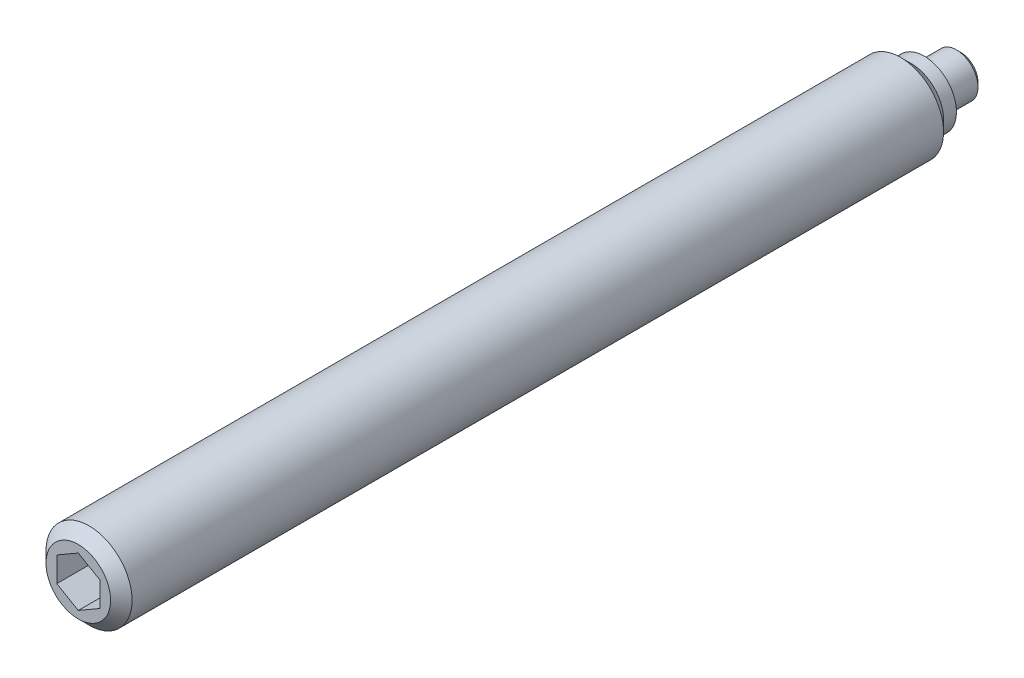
ISO-10303-21;
HEADER;
FILE_DESCRIPTION(('STEP AP214'),'2;1');
FILE_NAME('part.step','',(''),(''),'','','');
FILE_SCHEMA(('AUTOMOTIVE_DESIGN { 1 0 10303 214 1 1 1 1 }'));
ENDSEC;
DATA;
#1=APPLICATION_CONTEXT('core data for automotive mechanical design processes');
#2=APPLICATION_PROTOCOL_DEFINITION('international standard','automotive_design',2000,#1);
#3=PRODUCT_CONTEXT('',#1,'mechanical');
#4=PRODUCT('Part','Part','',(#3));
#5=PRODUCT_RELATED_PRODUCT_CATEGORY('part','',(#4));
#6=PRODUCT_DEFINITION_FORMATION('','',#4);
#7=PRODUCT_DEFINITION_CONTEXT('part definition',#1,'design');
#8=PRODUCT_DEFINITION('design','',#6,#7);
#9=PRODUCT_DEFINITION_SHAPE('','',#8);
#10=(LENGTH_UNIT() NAMED_UNIT(*) SI_UNIT(.MILLI.,.METRE.));
#11=(NAMED_UNIT(*) PLANE_ANGLE_UNIT() SI_UNIT($,.RADIAN.));
#12=(NAMED_UNIT(*) SI_UNIT($,.STERADIAN.) SOLID_ANGLE_UNIT());
#13=UNCERTAINTY_MEASURE_WITH_UNIT(LENGTH_MEASURE(1.E-05),#10,'distance_accuracy_value','');
#14=(GEOMETRIC_REPRESENTATION_CONTEXT(3) GLOBAL_UNCERTAINTY_ASSIGNED_CONTEXT((#13)) GLOBAL_UNIT_ASSIGNED_CONTEXT((#10,
#11,#12)) REPRESENTATION_CONTEXT('',''));
#15=CARTESIAN_POINT('',(0.,0.,0.));
#16=DIRECTION('',(0.,0.,1.));
#17=DIRECTION('',(1.,0.,0.));
#18=AXIS2_PLACEMENT_3D('',#15,#16,#17);
#19=CARTESIAN_POINT('',(0.,0.,0.));
#20=DIRECTION('',(0.,0.,-1.));
#21=DIRECTION('',(-1.,0.,0.));
#22=AXIS2_PLACEMENT_3D('',#19,#20,#21);
#23=CYLINDRICAL_SURFACE('',#22,1.);
#24=CARTESIAN_POINT('',(0.,0.,0.2));
#25=DIRECTION('',(0.,0.,-1.));
#26=DIRECTION('',(-1.,0.,0.));
#27=AXIS2_PLACEMENT_3D('',#24,#25,#26);
#28=CIRCLE('',#27,1.);
#29=CARTESIAN_POINT('',(-1.,0.,0.2));
#30=VERTEX_POINT('',#29);
#31=EDGE_CURVE('E133',#30,#30,#28,.T.);
#32=ORIENTED_EDGE('',*,*,#31,.F.);
#33=EDGE_LOOP('',(#32));
#34=FACE_BOUND('',#33,.T.);
#35=CARTESIAN_POINT('',(0.,0.,1.7));
#36=DIRECTION('',(0.,0.,-1.));
#37=DIRECTION('',(-1.,0.,0.));
#38=AXIS2_PLACEMENT_3D('',#35,#36,#37);
#39=CIRCLE('',#38,1.);
#40=CARTESIAN_POINT('',(-1.,0.,1.7));
#41=VERTEX_POINT('',#40);
#42=EDGE_CURVE('E127',#41,#41,#39,.T.);
#43=ORIENTED_EDGE('',*,*,#42,.T.);
#44=EDGE_LOOP('',(#43));
#45=FACE_BOUND('',#44,.T.);
#46=ADVANCED_FACE('F14',(#34,#45),#23,.T.);
#47=CARTESIAN_POINT('',(0.,0.,0.2));
#48=DIRECTION('',(0.,0.,1.));
#49=DIRECTION('',(1.,0.,0.));
#50=AXIS2_PLACEMENT_3D('',#47,#48,#49);
#51=CONICAL_SURFACE('',#50,1.,0.785398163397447);
#52=CARTESIAN_POINT('',(0.,0.,0.));
#53=DIRECTION('',(0.,0.,-1.));
#54=DIRECTION('',(-1.,0.,0.));
#55=AXIS2_PLACEMENT_3D('',#52,#53,#54);
#56=CIRCLE('',#55,0.8);
#57=CARTESIAN_POINT('',(-0.8,0.,0.));
#58=VERTEX_POINT('',#57);
#59=EDGE_CURVE('E130',#58,#58,#56,.T.);
#60=ORIENTED_EDGE('',*,*,#59,.F.);
#61=EDGE_LOOP('',(#60));
#62=FACE_BOUND('',#61,.T.);
#63=ORIENTED_EDGE('',*,*,#31,.T.);
#64=EDGE_LOOP('',(#63));
#65=FACE_BOUND('',#64,.T.);
#66=ADVANCED_FACE('F157',(#62,#65),#51,.T.);
#67=CARTESIAN_POINT('',(0.,0.8,0.));
#68=DIRECTION('',(0.,0.,1.));
#69=DIRECTION('',(1.,0.,0.));
#70=AXIS2_PLACEMENT_3D('',#67,#68,#69);
#71=PLANE('',#70);
#72=ORIENTED_EDGE('',*,*,#59,.T.);
#73=EDGE_LOOP('',(#72));
#74=FACE_BOUND('',#73,.T.);
#75=ADVANCED_FACE('F154',(#74),#71,.F.);
#76=CARTESIAN_POINT('',(0.,0.,1.7));
#77=DIRECTION('',(0.,0.,-1.));
#78=DIRECTION('',(-1.,0.,0.));
#79=AXIS2_PLACEMENT_3D('',#76,#77,#78);
#80=CYLINDRICAL_SURFACE('',#79,2.);
#81=CARTESIAN_POINT('',(0.,0.,2.8));
#82=DIRECTION('',(0.,0.,-1.));
#83=DIRECTION('',(-1.,0.,0.));
#84=AXIS2_PLACEMENT_3D('',#81,#82,#83);
#85=CIRCLE('',#84,2.);
#86=CARTESIAN_POINT('',(-2.,0.,2.8));
#87=VERTEX_POINT('',#86);
#88=EDGE_CURVE('E9',#87,#87,#85,.T.);
#89=ORIENTED_EDGE('',*,*,#88,.F.);
#90=EDGE_LOOP('',(#89));
#91=FACE_BOUND('',#90,.T.);
#92=CARTESIAN_POINT('',(0.,0.,40.5));
#93=DIRECTION('',(0.,0.,1.));
#94=DIRECTION('',(1.,0.,0.));
#95=AXIS2_PLACEMENT_3D('',#92,#93,#94);
#96=CIRCLE('',#95,2.);
#97=CARTESIAN_POINT('',(2.,0.,40.5));
#98=VERTEX_POINT('',#97);
#99=EDGE_CURVE('E124',#98,#98,#96,.T.);
#100=ORIENTED_EDGE('',*,*,#99,.F.);
#101=EDGE_LOOP('',(#100));
#102=FACE_BOUND('',#101,.T.);
#103=ADVANCED_FACE('F16',(#91,#102),#80,.T.);
#104=CARTESIAN_POINT('',(0.,0.,2.8));
#105=DIRECTION('',(0.,0.,1.));
#106=DIRECTION('',(1.,0.,0.));
#107=AXIS2_PLACEMENT_3D('',#104,#105,#106);
#108=CONICAL_SURFACE('',#107,2.,0.785398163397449);
#109=ORIENTED_EDGE('',*,*,#88,.T.);
#110=EDGE_LOOP('',(#109));
#111=FACE_BOUND('',#110,.T.);
#112=CARTESIAN_POINT('',(0.,0.,2.3));
#113=DIRECTION('',(0.,0.,-1.));
#114=DIRECTION('',(-1.,0.,0.));
#115=AXIS2_PLACEMENT_3D('',#112,#113,#114);
#116=CIRCLE('',#115,1.5);
#117=CARTESIAN_POINT('',(-1.5,0.,2.3));
#118=VERTEX_POINT('',#117);
#119=EDGE_CURVE('E22',#118,#118,#116,.T.);
#120=ORIENTED_EDGE('',*,*,#119,.F.);
#121=EDGE_LOOP('',(#120));
#122=FACE_BOUND('',#121,.T.);
#123=ADVANCED_FACE('F143',(#111,#122),#108,.T.);
#124=CARTESIAN_POINT('',(0.,0.,1.7));
#125=DIRECTION('',(0.,0.,-1.));
#126=DIRECTION('',(-1.,0.,0.));
#127=AXIS2_PLACEMENT_3D('',#124,#125,#126);
#128=CYLINDRICAL_SURFACE('',#127,1.5);
#129=CARTESIAN_POINT('',(0.,0.,1.7));
#130=DIRECTION('',(0.,0.,-1.));
#131=DIRECTION('',(-1.,0.,0.));
#132=AXIS2_PLACEMENT_3D('',#129,#130,#131);
#133=CIRCLE('',#132,1.5);
#134=CARTESIAN_POINT('',(-1.5,0.,1.7));
#135=VERTEX_POINT('',#134);
#136=EDGE_CURVE('E136',#135,#135,#133,.T.);
#137=ORIENTED_EDGE('',*,*,#136,.F.);
#138=EDGE_LOOP('',(#137));
#139=FACE_BOUND('',#138,.T.);
#140=ORIENTED_EDGE('',*,*,#119,.T.);
#141=EDGE_LOOP('',(#140));
#142=FACE_BOUND('',#141,.T.);
#143=ADVANCED_FACE('F141',(#139,#142),#128,.T.);
#144=CARTESIAN_POINT('',(0.,1.5,1.7));
#145=DIRECTION('',(0.,0.,1.));
#146=DIRECTION('',(1.,0.,0.));
#147=AXIS2_PLACEMENT_3D('',#144,#145,#146);
#148=PLANE('',#147);
#149=ORIENTED_EDGE('',*,*,#136,.T.);
#150=EDGE_LOOP('',(#149));
#151=FACE_BOUND('',#150,.T.);
#152=ORIENTED_EDGE('',*,*,#42,.F.);
#153=EDGE_LOOP('',(#152));
#154=FACE_BOUND('',#153,.T.);
#155=ADVANCED_FACE('F151',(#151,#154),#148,.F.);
#156=CARTESIAN_POINT('',(0.,-1.5,41.));
#157=DIRECTION('',(0.,0.,1.));
#158=DIRECTION('',(1.,0.,0.));
#159=AXIS2_PLACEMENT_3D('',#156,#157,#158);
#160=PLANE('',#159);
#161=DIRECTION('',(0.866025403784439,-0.5,0.));
#162=VECTOR('',#161,1.);
#163=CARTESIAN_POINT('',(-1.,-0.577350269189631,41.));
#164=LINE('',#163,#162);
#165=CARTESIAN_POINT('',(-1.,-0.577350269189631,41.));
#166=VERTEX_POINT('',#165);
#167=CARTESIAN_POINT('',(0.,-1.15470053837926,41.));
#168=VERTEX_POINT('',#167);
#169=EDGE_CURVE('E29',#166,#168,#164,.T.);
#170=ORIENTED_EDGE('',*,*,#169,.F.);
#171=DIRECTION('',(0.,-1.,0.));
#172=VECTOR('',#171,1.);
#173=CARTESIAN_POINT('',(-1.,0.577350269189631,41.));
#174=LINE('',#173,#172);
#175=CARTESIAN_POINT('',(-1.,0.577350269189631,41.));
#176=VERTEX_POINT('',#175);
#177=EDGE_CURVE('E112',#176,#166,#174,.T.);
#178=ORIENTED_EDGE('',*,*,#177,.F.);
#179=DIRECTION('',(-0.866025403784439,-0.5,0.));
#180=VECTOR('',#179,1.);
#181=CARTESIAN_POINT('',(0.,1.15470053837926,41.));
#182=LINE('',#181,#180);
#183=CARTESIAN_POINT('',(0.,1.15470053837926,41.));
#184=VERTEX_POINT('',#183);
#185=EDGE_CURVE('E110',#184,#176,#182,.T.);
#186=ORIENTED_EDGE('',*,*,#185,.F.);
#187=DIRECTION('',(-0.866025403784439,0.5,0.));
#188=VECTOR('',#187,1.);
#189=CARTESIAN_POINT('',(1.,0.577350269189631,41.));
#190=LINE('',#189,#188);
#191=CARTESIAN_POINT('',(1.,0.577350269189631,41.));
#192=VERTEX_POINT('',#191);
#193=EDGE_CURVE('E77',#192,#184,#190,.T.);
#194=ORIENTED_EDGE('',*,*,#193,.F.);
#195=DIRECTION('',(0.,1.,0.));
#196=VECTOR('',#195,1.);
#197=CARTESIAN_POINT('',(1.,-0.577350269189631,41.));
#198=LINE('',#197,#196);
#199=CARTESIAN_POINT('',(1.,-0.577350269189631,41.));
#200=VERTEX_POINT('',#199);
#201=EDGE_CURVE('E106',#200,#192,#198,.T.);
#202=ORIENTED_EDGE('',*,*,#201,.F.);
#203=DIRECTION('',(0.866025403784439,0.5,0.));
#204=VECTOR('',#203,1.);
#205=CARTESIAN_POINT('',(0.,-1.15470053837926,41.));
#206=LINE('',#205,#204);
#207=EDGE_CURVE('E103',#168,#200,#206,.T.);
#208=ORIENTED_EDGE('',*,*,#207,.F.);
#209=EDGE_LOOP('',(#170,#178,#186,#194,#202,#208));
#210=FACE_BOUND('',#209,.T.);
#211=CARTESIAN_POINT('',(0.,0.,41.));
#212=DIRECTION('',(0.,0.,1.));
#213=DIRECTION('',(1.,0.,0.));
#214=AXIS2_PLACEMENT_3D('',#211,#212,#213);
#215=CIRCLE('',#214,1.5);
#216=CARTESIAN_POINT('',(1.5,0.,41.));
#217=VERTEX_POINT('',#216);
#218=EDGE_CURVE('E116',#217,#217,#215,.T.);
#219=ORIENTED_EDGE('',*,*,#218,.T.);
#220=EDGE_LOOP('',(#219));
#221=FACE_BOUND('',#220,.T.);
#222=ADVANCED_FACE('F170',(#210,#221),#160,.T.);
#223=CARTESIAN_POINT('',(0.,0.,41.));
#224=DIRECTION('',(0.,0.,-1.));
#225=DIRECTION('',(-1.,0.,0.));
#226=AXIS2_PLACEMENT_3D('',#223,#224,#225);
#227=CONICAL_SURFACE('',#226,1.5,0.785398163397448);
#228=ORIENTED_EDGE('',*,*,#99,.T.);
#229=EDGE_LOOP('',(#228));
#230=FACE_BOUND('',#229,.T.);
#231=ORIENTED_EDGE('',*,*,#218,.F.);
#232=EDGE_LOOP('',(#231));
#233=FACE_BOUND('',#232,.T.);
#234=ADVANCED_FACE('F175',(#230,#233),#227,.T.);
#235=CARTESIAN_POINT('',(-1.,-0.577350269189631,38.5));
#236=DIRECTION('',(-0.5,-0.866025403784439,0.));
#237=DIRECTION('',(0.866025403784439,-0.5,0.));
#238=AXIS2_PLACEMENT_3D('',#235,#236,#237);
#239=PLANE('',#238);
#240=ORIENTED_EDGE('',*,*,#169,.T.);
#241=DIRECTION('',(0.,0.,1.));
#242=VECTOR('',#241,1.);
#243=CARTESIAN_POINT('',(0.,-1.15470053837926,38.5));
#244=LINE('',#243,#242);
#245=CARTESIAN_POINT('',(0.,-1.15470053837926,38.5));
#246=VERTEX_POINT('',#245);
#247=EDGE_CURVE('E59',#246,#168,#244,.T.);
#248=ORIENTED_EDGE('',*,*,#247,.F.);
#249=DIRECTION('',(0.866025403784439,-0.5,0.));
#250=VECTOR('',#249,1.);
#251=CARTESIAN_POINT('',(-1.,-0.577350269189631,38.5));
#252=LINE('',#251,#250);
#253=CARTESIAN_POINT('',(-1.,-0.577350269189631,38.5));
#254=VERTEX_POINT('',#253);
#255=EDGE_CURVE('E114',#254,#246,#252,.T.);
#256=ORIENTED_EDGE('',*,*,#255,.F.);
#257=DIRECTION('',(0.,0.,1.));
#258=VECTOR('',#257,1.);
#259=CARTESIAN_POINT('',(-1.,-0.577350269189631,38.5));
#260=LINE('',#259,#258);
#261=EDGE_CURVE('E37',#254,#166,#260,.T.);
#262=ORIENTED_EDGE('',*,*,#261,.T.);
#263=EDGE_LOOP('',(#240,#248,#256,#262));
#264=FACE_BOUND('',#263,.T.);
#265=ADVANCED_FACE('F184',(#264),#239,.F.);
#266=CARTESIAN_POINT('',(-1.,0.577350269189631,38.5));
#267=DIRECTION('',(-1.,0.,0.));
#268=DIRECTION('',(0.,0.,1.));
#269=AXIS2_PLACEMENT_3D('',#266,#267,#268);
#270=PLANE('',#269);
#271=ORIENTED_EDGE('',*,*,#177,.T.);
#272=ORIENTED_EDGE('',*,*,#261,.F.);
#273=DIRECTION('',(0.,-1.,0.));
#274=VECTOR('',#273,1.);
#275=CARTESIAN_POINT('',(-1.,0.577350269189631,38.5));
#276=LINE('',#275,#274);
#277=CARTESIAN_POINT('',(-1.,0.577350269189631,38.5));
#278=VERTEX_POINT('',#277);
#279=EDGE_CURVE('E89',#278,#254,#276,.T.);
#280=ORIENTED_EDGE('',*,*,#279,.F.);
#281=DIRECTION('',(0.,0.,1.));
#282=VECTOR('',#281,1.);
#283=CARTESIAN_POINT('',(-1.,0.577350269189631,38.5));
#284=LINE('',#283,#282);
#285=EDGE_CURVE('E81',#278,#176,#284,.T.);
#286=ORIENTED_EDGE('',*,*,#285,.T.);
#287=EDGE_LOOP('',(#271,#272,#280,#286));
#288=FACE_BOUND('',#287,.T.);
#289=ADVANCED_FACE('F244',(#288),#270,.F.);
#290=CARTESIAN_POINT('',(0.,1.15470053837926,38.5));
#291=DIRECTION('',(-0.5,0.866025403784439,0.));
#292=DIRECTION('',(-0.866025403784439,-0.5,0.));
#293=AXIS2_PLACEMENT_3D('',#290,#291,#292);
#294=PLANE('',#293);
#295=ORIENTED_EDGE('',*,*,#185,.T.);
#296=ORIENTED_EDGE('',*,*,#285,.F.);
#297=DIRECTION('',(-0.866025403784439,-0.5,0.));
#298=VECTOR('',#297,1.);
#299=CARTESIAN_POINT('',(0.,1.15470053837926,38.5));
#300=LINE('',#299,#298);
#301=CARTESIAN_POINT('',(0.,1.15470053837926,38.5));
#302=VERTEX_POINT('',#301);
#303=EDGE_CURVE('E85',#302,#278,#300,.T.);
#304=ORIENTED_EDGE('',*,*,#303,.F.);
#305=DIRECTION('',(0.,0.,1.));
#306=VECTOR('',#305,1.);
#307=CARTESIAN_POINT('',(0.,1.15470053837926,38.5));
#308=LINE('',#307,#306);
#309=EDGE_CURVE('E70',#302,#184,#308,.T.);
#310=ORIENTED_EDGE('',*,*,#309,.T.);
#311=EDGE_LOOP('',(#295,#296,#304,#310));
#312=FACE_BOUND('',#311,.T.);
#313=ADVANCED_FACE('F86',(#312),#294,.F.);
#314=CARTESIAN_POINT('',(1.,0.577350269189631,38.5));
#315=DIRECTION('',(0.5,0.866025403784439,0.));
#316=DIRECTION('',(-0.866025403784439,0.5,0.));
#317=AXIS2_PLACEMENT_3D('',#314,#315,#316);
#318=PLANE('',#317);
#319=ORIENTED_EDGE('',*,*,#193,.T.);
#320=ORIENTED_EDGE('',*,*,#309,.F.);
#321=DIRECTION('',(-0.866025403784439,0.5,0.));
#322=VECTOR('',#321,1.);
#323=CARTESIAN_POINT('',(1.,0.577350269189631,38.5));
#324=LINE('',#323,#322);
#325=CARTESIAN_POINT('',(1.,0.577350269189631,38.5));
#326=VERTEX_POINT('',#325);
#327=EDGE_CURVE('E74',#326,#302,#324,.T.);
#328=ORIENTED_EDGE('',*,*,#327,.F.);
#329=DIRECTION('',(0.,0.,1.));
#330=VECTOR('',#329,1.);
#331=CARTESIAN_POINT('',(1.,0.577350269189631,38.5));
#332=LINE('',#331,#330);
#333=EDGE_CURVE('E82',#326,#192,#332,.T.);
#334=ORIENTED_EDGE('',*,*,#333,.T.);
#335=EDGE_LOOP('',(#319,#320,#328,#334));
#336=FACE_BOUND('',#335,.T.);
#337=ADVANCED_FACE('F72',(#336),#318,.F.);
#338=CARTESIAN_POINT('',(1.,-0.577350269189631,38.5));
#339=DIRECTION('',(1.,0.,0.));
#340=DIRECTION('',(0.,0.,-1.));
#341=AXIS2_PLACEMENT_3D('',#338,#339,#340);
#342=PLANE('',#341);
#343=ORIENTED_EDGE('',*,*,#201,.T.);
#344=ORIENTED_EDGE('',*,*,#333,.F.);
#345=DIRECTION('',(0.,1.,0.));
#346=VECTOR('',#345,1.);
#347=CARTESIAN_POINT('',(1.,-0.577350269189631,38.5));
#348=LINE('',#347,#346);
#349=CARTESIAN_POINT('',(1.,-0.577350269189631,38.5));
#350=VERTEX_POINT('',#349);
#351=EDGE_CURVE('E95',#350,#326,#348,.T.);
#352=ORIENTED_EDGE('',*,*,#351,.F.);
#353=DIRECTION('',(0.,0.,1.));
#354=VECTOR('',#353,1.);
#355=CARTESIAN_POINT('',(1.,-0.577350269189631,38.5));
#356=LINE('',#355,#354);
#357=EDGE_CURVE('E119',#350,#200,#356,.T.);
#358=ORIENTED_EDGE('',*,*,#357,.T.);
#359=EDGE_LOOP('',(#343,#344,#352,#358));
#360=FACE_BOUND('',#359,.T.);
#361=ADVANCED_FACE('F268',(#360),#342,.F.);
#362=CARTESIAN_POINT('',(0.,-1.15470053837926,38.5));
#363=DIRECTION('',(0.5,-0.866025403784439,0.));
#364=DIRECTION('',(0.866025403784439,0.5,0.));
#365=AXIS2_PLACEMENT_3D('',#362,#363,#364);
#366=PLANE('',#365);
#367=ORIENTED_EDGE('',*,*,#207,.T.);
#368=ORIENTED_EDGE('',*,*,#357,.F.);
#369=DIRECTION('',(0.866025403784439,0.5,0.));
#370=VECTOR('',#369,1.);
#371=CARTESIAN_POINT('',(0.,-1.15470053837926,38.5));
#372=LINE('',#371,#370);
#373=EDGE_CURVE('E97',#246,#350,#372,.T.);
#374=ORIENTED_EDGE('',*,*,#373,.F.);
#375=ORIENTED_EDGE('',*,*,#247,.T.);
#376=EDGE_LOOP('',(#367,#368,#374,#375));
#377=FACE_BOUND('',#376,.T.);
#378=ADVANCED_FACE('F277',(#377),#366,.F.);
#379=CARTESIAN_POINT('',(0.,0.,38.5));
#380=DIRECTION('',(0.,0.,1.));
#381=DIRECTION('',(1.,0.,0.));
#382=AXIS2_PLACEMENT_3D('',#379,#380,#381);
#383=PLANE('',#382);
#384=ORIENTED_EDGE('',*,*,#255,.T.);
#385=ORIENTED_EDGE('',*,*,#373,.T.);
#386=ORIENTED_EDGE('',*,*,#351,.T.);
#387=ORIENTED_EDGE('',*,*,#327,.T.);
#388=ORIENTED_EDGE('',*,*,#303,.T.);
#389=ORIENTED_EDGE('',*,*,#279,.T.);
#390=EDGE_LOOP('',(#384,#385,#386,#387,#388,#389));
#391=FACE_BOUND('',#390,.T.);
#392=ADVANCED_FACE('F92',(#391),#383,.T.);
#393=CLOSED_SHELL('',(#46,#66,#75,#103,#123,#143,#155,#222,#234,#265,#289,#313,#337,#361,#378,#392));
#394=MANIFOLD_SOLID_BREP('B1',#393);
#395=ADVANCED_BREP_SHAPE_REPRESENTATION('',(#18,#394),#14);
#396=SHAPE_DEFINITION_REPRESENTATION(#9,#395);
ENDSEC;
END-ISO-10303-21;
